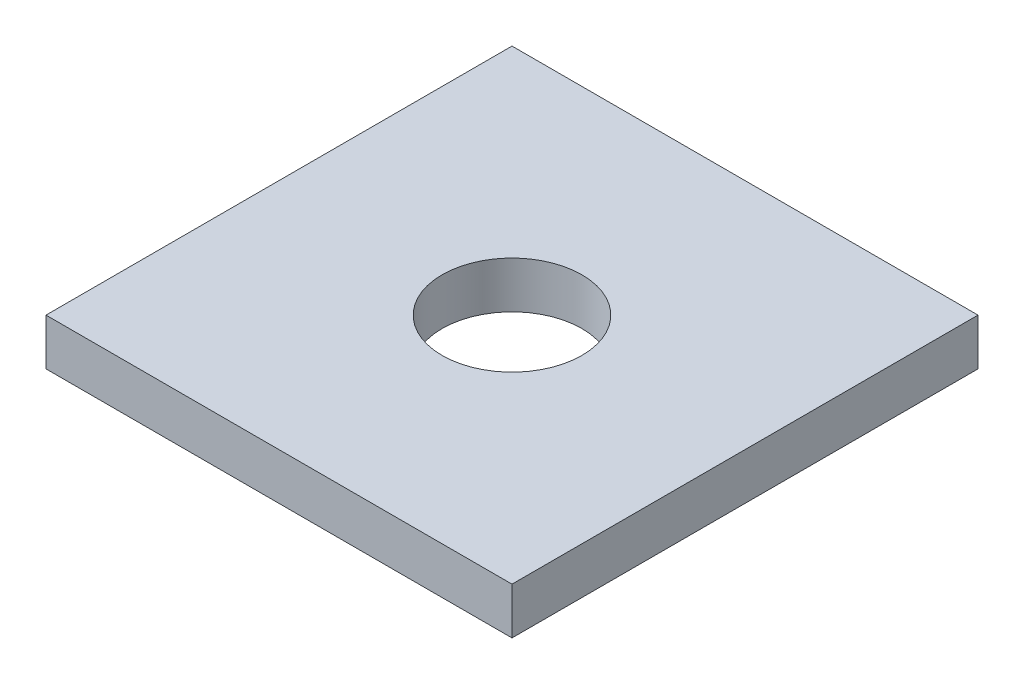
ISO-10303-21;
HEADER;
FILE_DESCRIPTION(('STEP AP214'),'2;1');
FILE_NAME('part.step','',(''),(''),'','','');
FILE_SCHEMA(('AUTOMOTIVE_DESIGN { 1 0 10303 214 1 1 1 1 }'));
ENDSEC;
DATA;
#1=APPLICATION_CONTEXT('core data for automotive mechanical design processes');
#2=APPLICATION_PROTOCOL_DEFINITION('international standard','automotive_design',2000,#1);
#3=PRODUCT_CONTEXT('',#1,'mechanical');
#4=PRODUCT('Part','Part','',(#3));
#5=PRODUCT_RELATED_PRODUCT_CATEGORY('part','',(#4));
#6=PRODUCT_DEFINITION_FORMATION('','',#4);
#7=PRODUCT_DEFINITION_CONTEXT('part definition',#1,'design');
#8=PRODUCT_DEFINITION('design','',#6,#7);
#9=PRODUCT_DEFINITION_SHAPE('','',#8);
#10=(LENGTH_UNIT() NAMED_UNIT(*) SI_UNIT(.MILLI.,.METRE.));
#11=(NAMED_UNIT(*) PLANE_ANGLE_UNIT() SI_UNIT($,.RADIAN.));
#12=(NAMED_UNIT(*) SI_UNIT($,.STERADIAN.) SOLID_ANGLE_UNIT());
#13=UNCERTAINTY_MEASURE_WITH_UNIT(LENGTH_MEASURE(1.E-05),#10,'distance_accuracy_value','');
#14=(GEOMETRIC_REPRESENTATION_CONTEXT(3) GLOBAL_UNCERTAINTY_ASSIGNED_CONTEXT((#13)) GLOBAL_UNIT_ASSIGNED_CONTEXT((#10,
#11,#12)) REPRESENTATION_CONTEXT('',''));
#15=CARTESIAN_POINT('',(0.,0.,0.));
#16=DIRECTION('',(0.,0.,1.));
#17=DIRECTION('',(1.,0.,0.));
#18=AXIS2_PLACEMENT_3D('',#15,#16,#17);
#19=CARTESIAN_POINT('',(0.,3.,-30.));
#20=DIRECTION('',(0.,-1.,0.));
#21=DIRECTION('',(0.,0.,-1.));
#22=AXIS2_PLACEMENT_3D('',#19,#20,#21);
#23=PLANE('',#22);
#24=DIRECTION('',(0.,0.,1.));
#25=VECTOR('',#24,1.);
#26=CARTESIAN_POINT('',(0.,3.,0.));
#27=LINE('',#26,#25);
#28=CARTESIAN_POINT('',(0.,3.,-30.));
#29=VERTEX_POINT('',#28);
#30=CARTESIAN_POINT('',(0.,3.,0.));
#31=VERTEX_POINT('',#30);
#32=EDGE_CURVE('E83',#29,#31,#27,.T.);
#33=ORIENTED_EDGE('',*,*,#32,.T.);
#34=DIRECTION('',(1.,0.,0.));
#35=VECTOR('',#34,1.);
#36=CARTESIAN_POINT('',(0.,3.,0.));
#37=LINE('',#36,#35);
#38=CARTESIAN_POINT('',(30.,3.,0.));
#39=VERTEX_POINT('',#38);
#40=EDGE_CURVE('E78',#31,#39,#37,.T.);
#41=ORIENTED_EDGE('',*,*,#40,.T.);
#42=DIRECTION('',(0.,0.,-1.));
#43=VECTOR('',#42,1.);
#44=CARTESIAN_POINT('',(30.,3.,0.));
#45=LINE('',#44,#43);
#46=CARTESIAN_POINT('',(30.,3.,-30.));
#47=VERTEX_POINT('',#46);
#48=EDGE_CURVE('E81',#39,#47,#45,.T.);
#49=ORIENTED_EDGE('',*,*,#48,.T.);
#50=DIRECTION('',(-1.,0.,0.));
#51=VECTOR('',#50,1.);
#52=CARTESIAN_POINT('',(0.,3.,-30.));
#53=LINE('',#52,#51);
#54=EDGE_CURVE('E48',#47,#29,#53,.T.);
#55=ORIENTED_EDGE('',*,*,#54,.T.);
#56=EDGE_LOOP('',(#33,#41,#49,#55));
#57=FACE_BOUND('',#56,.T.);
#58=CARTESIAN_POINT('',(15.,3.,-15.));
#59=DIRECTION('',(0.,1.,0.));
#60=DIRECTION('',(0.,0.,1.));
#61=AXIS2_PLACEMENT_3D('',#58,#59,#60);
#62=CIRCLE('',#61,4.5);
#63=CARTESIAN_POINT('',(15.,3.,-10.5));
#64=VERTEX_POINT('',#63);
#65=EDGE_CURVE('E98',#64,#64,#62,.T.);
#66=ORIENTED_EDGE('',*,*,#65,.F.);
#67=EDGE_LOOP('',(#66));
#68=FACE_BOUND('',#67,.T.);
#69=ADVANCED_FACE('F31',(#57,#68),#23,.F.);
#70=CARTESIAN_POINT('',(0.,0.,-30.));
#71=DIRECTION('',(0.,-1.,0.));
#72=DIRECTION('',(0.,0.,-1.));
#73=AXIS2_PLACEMENT_3D('',#70,#71,#72);
#74=PLANE('',#73);
#75=DIRECTION('',(0.,0.,1.));
#76=VECTOR('',#75,1.);
#77=CARTESIAN_POINT('',(0.,0.,0.));
#78=LINE('',#77,#76);
#79=CARTESIAN_POINT('',(0.,0.,-30.));
#80=VERTEX_POINT('',#79);
#81=CARTESIAN_POINT('',(0.,0.,0.));
#82=VERTEX_POINT('',#81);
#83=EDGE_CURVE('E95',#80,#82,#78,.T.);
#84=ORIENTED_EDGE('',*,*,#83,.F.);
#85=DIRECTION('',(-1.,0.,0.));
#86=VECTOR('',#85,1.);
#87=CARTESIAN_POINT('',(0.,0.,-30.));
#88=LINE('',#87,#86);
#89=CARTESIAN_POINT('',(30.,0.,-30.));
#90=VERTEX_POINT('',#89);
#91=EDGE_CURVE('E71',#90,#80,#88,.T.);
#92=ORIENTED_EDGE('',*,*,#91,.F.);
#93=DIRECTION('',(0.,0.,-1.));
#94=VECTOR('',#93,1.);
#95=CARTESIAN_POINT('',(30.,0.,0.));
#96=LINE('',#95,#94);
#97=CARTESIAN_POINT('',(30.,0.,0.));
#98=VERTEX_POINT('',#97);
#99=EDGE_CURVE('E65',#98,#90,#96,.T.);
#100=ORIENTED_EDGE('',*,*,#99,.F.);
#101=DIRECTION('',(1.,0.,0.));
#102=VECTOR('',#101,1.);
#103=CARTESIAN_POINT('',(0.,0.,0.));
#104=LINE('',#103,#102);
#105=EDGE_CURVE('E87',#82,#98,#104,.T.);
#106=ORIENTED_EDGE('',*,*,#105,.F.);
#107=EDGE_LOOP('',(#84,#92,#100,#106));
#108=FACE_BOUND('',#107,.T.);
#109=CARTESIAN_POINT('',(15.,0.,-15.));
#110=DIRECTION('',(0.,1.,0.));
#111=DIRECTION('',(0.,0.,1.));
#112=AXIS2_PLACEMENT_3D('',#109,#110,#111);
#113=CIRCLE('',#112,4.5);
#114=CARTESIAN_POINT('',(15.,0.,-10.5));
#115=VERTEX_POINT('',#114);
#116=EDGE_CURVE('E110',#115,#115,#113,.T.);
#117=ORIENTED_EDGE('',*,*,#116,.T.);
#118=EDGE_LOOP('',(#117));
#119=FACE_BOUND('',#118,.T.);
#120=ADVANCED_FACE('F106',(#108,#119),#74,.T.);
#121=CARTESIAN_POINT('',(0.,3.,0.));
#122=DIRECTION('',(1.,0.,0.));
#123=DIRECTION('',(0.,0.,-1.));
#124=AXIS2_PLACEMENT_3D('',#121,#122,#123);
#125=PLANE('',#124);
#126=ORIENTED_EDGE('',*,*,#83,.T.);
#127=DIRECTION('',(0.,-1.,0.));
#128=VECTOR('',#127,1.);
#129=CARTESIAN_POINT('',(0.,3.,0.));
#130=LINE('',#129,#128);
#131=EDGE_CURVE('E11',#31,#82,#130,.T.);
#132=ORIENTED_EDGE('',*,*,#131,.F.);
#133=ORIENTED_EDGE('',*,*,#32,.F.);
#134=DIRECTION('',(0.,-1.,0.));
#135=VECTOR('',#134,1.);
#136=CARTESIAN_POINT('',(0.,3.,-30.));
#137=LINE('',#136,#135);
#138=EDGE_CURVE('E91',#29,#80,#137,.T.);
#139=ORIENTED_EDGE('',*,*,#138,.T.);
#140=EDGE_LOOP('',(#126,#132,#133,#139));
#141=FACE_BOUND('',#140,.T.);
#142=ADVANCED_FACE('F33',(#141),#125,.F.);
#143=CARTESIAN_POINT('',(0.,3.,0.));
#144=DIRECTION('',(0.,0.,-1.));
#145=DIRECTION('',(-1.,0.,0.));
#146=AXIS2_PLACEMENT_3D('',#143,#144,#145);
#147=PLANE('',#146);
#148=ORIENTED_EDGE('',*,*,#105,.T.);
#149=DIRECTION('',(0.,-1.,0.));
#150=VECTOR('',#149,1.);
#151=CARTESIAN_POINT('',(30.,3.,0.));
#152=LINE('',#151,#150);
#153=EDGE_CURVE('E40',#39,#98,#152,.T.);
#154=ORIENTED_EDGE('',*,*,#153,.F.);
#155=ORIENTED_EDGE('',*,*,#40,.F.);
#156=ORIENTED_EDGE('',*,*,#131,.T.);
#157=EDGE_LOOP('',(#148,#154,#155,#156));
#158=FACE_BOUND('',#157,.T.);
#159=ADVANCED_FACE('F86',(#158),#147,.F.);
#160=CARTESIAN_POINT('',(30.,3.,0.));
#161=DIRECTION('',(-1.,0.,0.));
#162=DIRECTION('',(0.,0.,1.));
#163=AXIS2_PLACEMENT_3D('',#160,#161,#162);
#164=PLANE('',#163);
#165=ORIENTED_EDGE('',*,*,#99,.T.);
#166=DIRECTION('',(0.,-1.,0.));
#167=VECTOR('',#166,1.);
#168=CARTESIAN_POINT('',(30.,3.,-30.));
#169=LINE('',#168,#167);
#170=EDGE_CURVE('E88',#47,#90,#169,.T.);
#171=ORIENTED_EDGE('',*,*,#170,.F.);
#172=ORIENTED_EDGE('',*,*,#48,.F.);
#173=ORIENTED_EDGE('',*,*,#153,.T.);
#174=EDGE_LOOP('',(#165,#171,#172,#173));
#175=FACE_BOUND('',#174,.T.);
#176=ADVANCED_FACE('F89',(#175),#164,.F.);
#177=CARTESIAN_POINT('',(0.,3.,-30.));
#178=DIRECTION('',(0.,0.,1.));
#179=DIRECTION('',(1.,0.,0.));
#180=AXIS2_PLACEMENT_3D('',#177,#178,#179);
#181=PLANE('',#180);
#182=ORIENTED_EDGE('',*,*,#91,.T.);
#183=ORIENTED_EDGE('',*,*,#138,.F.);
#184=ORIENTED_EDGE('',*,*,#54,.F.);
#185=ORIENTED_EDGE('',*,*,#170,.T.);
#186=EDGE_LOOP('',(#182,#183,#184,#185));
#187=FACE_BOUND('',#186,.T.);
#188=ADVANCED_FACE('F103',(#187),#181,.F.);
#189=CARTESIAN_POINT('',(15.,3.,-15.));
#190=DIRECTION('',(0.,-1.,0.));
#191=DIRECTION('',(0.,0.,-1.));
#192=AXIS2_PLACEMENT_3D('',#189,#190,#191);
#193=CYLINDRICAL_SURFACE('',#192,4.5);
#194=ORIENTED_EDGE('',*,*,#65,.T.);
#195=EDGE_LOOP('',(#194));
#196=FACE_BOUND('',#195,.T.);
#197=ORIENTED_EDGE('',*,*,#116,.F.);
#198=EDGE_LOOP('',(#197));
#199=FACE_BOUND('',#198,.T.);
#200=ADVANCED_FACE('F116',(#196,#199),#193,.F.);
#201=CLOSED_SHELL('',(#69,#120,#142,#159,#176,#188,#200));
#202=MANIFOLD_SOLID_BREP('B2',#201);
#203=ADVANCED_BREP_SHAPE_REPRESENTATION('',(#18,#202),#14);
#204=SHAPE_DEFINITION_REPRESENTATION(#9,#203);
ENDSEC;
END-ISO-10303-21;
